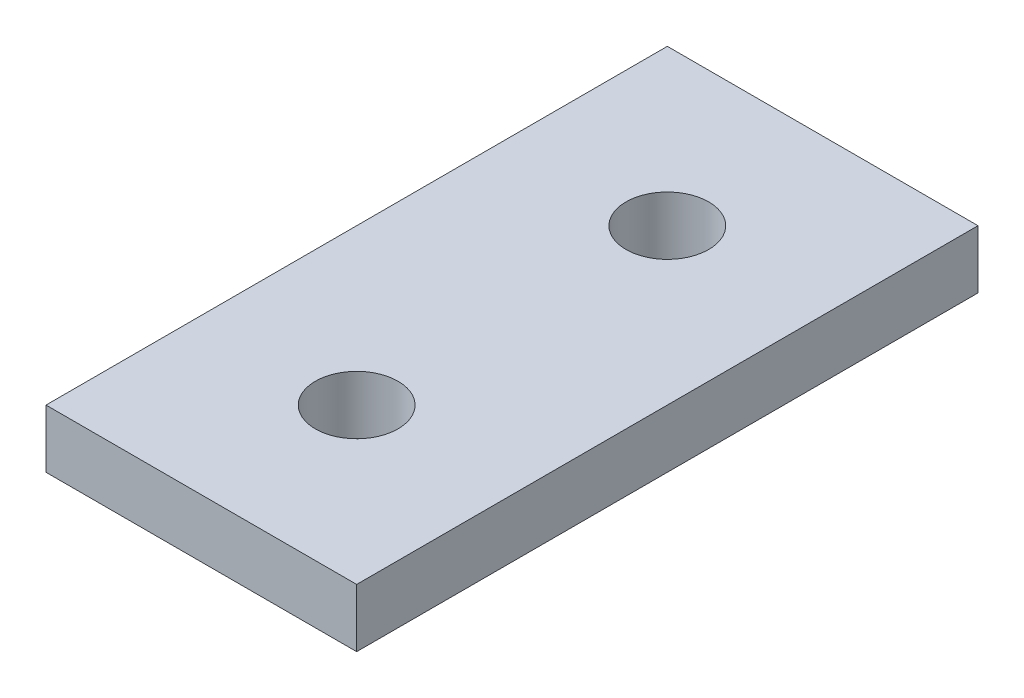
from build123d import *

# Parameters (mm, degrees)
SKETCH1_W           = 25.4
SKETCH1_H           = 50.8
SKETCH1_R           = 3.3782
BOSS_EXTRUDE1_DEPTH = 4.7625


with BuildPart() as part:
    # Sketch1 → Boss-Extrude1 (new body)
    with BuildSketch(Plane(origin=(0, 0, 0), x_dir=(1, 0, 0), z_dir=(0, 1, 0))):
        with Locations((12.7, 25.4)):
            Rectangle(SKETCH1_W, SKETCH1_H)
        with Locations(Location((12.7, 38.1, 0), (0, 0, 90))):
            Circle(SKETCH1_R, mode=Mode.SUBTRACT)
        with Locations(Location((12.7, 12.7, 0), (0, 0, 90))):
            Circle(SKETCH1_R, mode=Mode.SUBTRACT)
    extrude(amount=BOSS_EXTRUDE1_DEPTH)


solid = part.part
